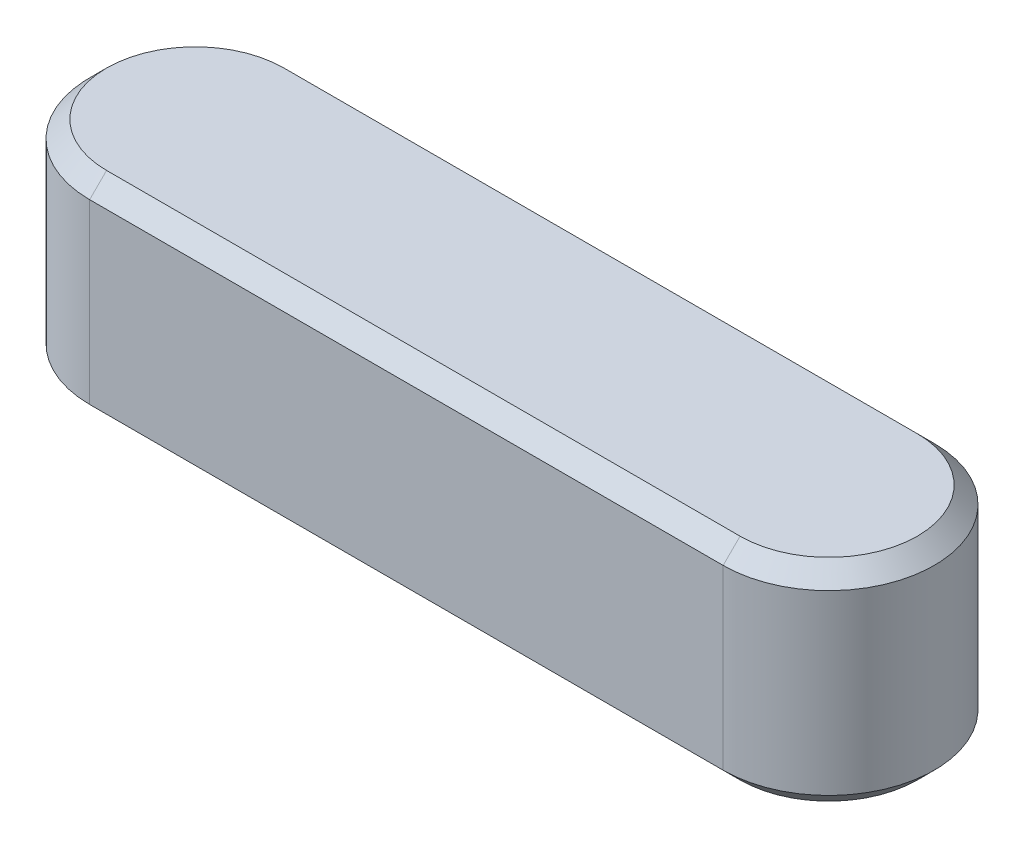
ISO-10303-21;
HEADER;
FILE_DESCRIPTION(('STEP AP214'),'2;1');
FILE_NAME('part.step','',(''),(''),'','','');
FILE_SCHEMA(('AUTOMOTIVE_DESIGN { 1 0 10303 214 1 1 1 1 }'));
ENDSEC;
DATA;
#1=APPLICATION_CONTEXT('core data for automotive mechanical design processes');
#2=APPLICATION_PROTOCOL_DEFINITION('international standard','automotive_design',2000,#1);
#3=PRODUCT_CONTEXT('',#1,'mechanical');
#4=PRODUCT('Part','Part','',(#3));
#5=PRODUCT_RELATED_PRODUCT_CATEGORY('part','',(#4));
#6=PRODUCT_DEFINITION_FORMATION('','',#4);
#7=PRODUCT_DEFINITION_CONTEXT('part definition',#1,'design');
#8=PRODUCT_DEFINITION('design','',#6,#7);
#9=PRODUCT_DEFINITION_SHAPE('','',#8);
#10=(LENGTH_UNIT() NAMED_UNIT(*) SI_UNIT(.MILLI.,.METRE.));
#11=(NAMED_UNIT(*) PLANE_ANGLE_UNIT() SI_UNIT($,.RADIAN.));
#12=(NAMED_UNIT(*) SI_UNIT($,.STERADIAN.) SOLID_ANGLE_UNIT());
#13=UNCERTAINTY_MEASURE_WITH_UNIT(LENGTH_MEASURE(1.E-05),#10,'distance_accuracy_value','');
#14=(GEOMETRIC_REPRESENTATION_CONTEXT(3) GLOBAL_UNCERTAINTY_ASSIGNED_CONTEXT((#13)) GLOBAL_UNIT_ASSIGNED_CONTEXT((#10,
#11,#12)) REPRESENTATION_CONTEXT('',''));
#15=CARTESIAN_POINT('',(0.,0.,0.));
#16=DIRECTION('',(0.,0.,1.));
#17=DIRECTION('',(1.,0.,0.));
#18=AXIS2_PLACEMENT_3D('',#15,#16,#17);
#19=CARTESIAN_POINT('',(7.,0.,0.));
#20=DIRECTION('',(0.,-1.,0.));
#21=DIRECTION('',(0.,0.,-1.));
#22=AXIS2_PLACEMENT_3D('',#19,#20,#21);
#23=CYLINDRICAL_SURFACE('',#22,1.);
#24=DIRECTION('',(0.,-1.,0.));
#25=VECTOR('',#24,1.);
#26=CARTESIAN_POINT('',(7.,2.,1.));
#27=LINE('',#26,#25);
#28=CARTESIAN_POINT('',(7.,0.16,1.));
#29=VERTEX_POINT('',#28);
#30=CARTESIAN_POINT('',(7.,1.84,1.));
#31=VERTEX_POINT('',#30);
#32=EDGE_CURVE('E122',#29,#31,#27,.F.);
#33=ORIENTED_EDGE('',*,*,#32,.F.);
#34=CARTESIAN_POINT('',(7.,0.16,0.));
#35=DIRECTION('',(0.,-1.,0.));
#36=DIRECTION('',(0.,0.,-1.));
#37=AXIS2_PLACEMENT_3D('',#34,#35,#36);
#38=CIRCLE('',#37,1.);
#39=CARTESIAN_POINT('',(7.,0.16,-1.));
#40=VERTEX_POINT('',#39);
#41=EDGE_CURVE('E121',#29,#40,#38,.F.);
#42=ORIENTED_EDGE('',*,*,#41,.T.);
#43=DIRECTION('',(0.,-1.,0.));
#44=VECTOR('',#43,1.);
#45=CARTESIAN_POINT('',(7.,2.,-1.));
#46=LINE('',#45,#44);
#47=CARTESIAN_POINT('',(7.,1.84,-1.));
#48=VERTEX_POINT('',#47);
#49=EDGE_CURVE('E105',#48,#40,#46,.T.);
#50=ORIENTED_EDGE('',*,*,#49,.F.);
#51=CARTESIAN_POINT('',(7.,1.84,0.));
#52=DIRECTION('',(0.,-1.,0.));
#53=DIRECTION('',(0.,0.,-1.));
#54=AXIS2_PLACEMENT_3D('',#51,#52,#53);
#55=CIRCLE('',#54,1.);
#56=EDGE_CURVE('E118',#48,#31,#55,.T.);
#57=ORIENTED_EDGE('',*,*,#56,.T.);
#58=EDGE_LOOP('',(#33,#42,#50,#57));
#59=FACE_BOUND('',#58,.T.);
#60=ADVANCED_FACE('F33',(#59),#23,.T.);
#61=CARTESIAN_POINT('',(1.,2.,0.));
#62=DIRECTION('',(0.,-1.,0.));
#63=DIRECTION('',(0.,0.,-1.));
#64=AXIS2_PLACEMENT_3D('',#61,#62,#63);
#65=CYLINDRICAL_SURFACE('',#64,1.);
#66=DIRECTION('',(0.,-1.,0.));
#67=VECTOR('',#66,1.);
#68=CARTESIAN_POINT('',(1.,2.,-1.));
#69=LINE('',#68,#67);
#70=CARTESIAN_POINT('',(1.,0.16,-1.));
#71=VERTEX_POINT('',#70);
#72=CARTESIAN_POINT('',(1.,1.84,-1.));
#73=VERTEX_POINT('',#72);
#74=EDGE_CURVE('E108',#71,#73,#69,.F.);
#75=ORIENTED_EDGE('',*,*,#74,.F.);
#76=CARTESIAN_POINT('',(1.,0.16,0.));
#77=DIRECTION('',(0.,-1.,0.));
#78=DIRECTION('',(0.,0.,-1.));
#79=AXIS2_PLACEMENT_3D('',#76,#77,#78);
#80=CIRCLE('',#79,1.);
#81=CARTESIAN_POINT('',(1.,0.16,1.));
#82=VERTEX_POINT('',#81);
#83=EDGE_CURVE('E159',#71,#82,#80,.F.);
#84=ORIENTED_EDGE('',*,*,#83,.T.);
#85=DIRECTION('',(0.,-1.,0.));
#86=VECTOR('',#85,1.);
#87=CARTESIAN_POINT('',(1.,2.,1.));
#88=LINE('',#87,#86);
#89=CARTESIAN_POINT('',(1.,1.84,1.));
#90=VERTEX_POINT('',#89);
#91=EDGE_CURVE('E146',#90,#82,#88,.T.);
#92=ORIENTED_EDGE('',*,*,#91,.F.);
#93=CARTESIAN_POINT('',(1.,1.84,0.));
#94=DIRECTION('',(0.,-1.,0.));
#95=DIRECTION('',(0.,0.,-1.));
#96=AXIS2_PLACEMENT_3D('',#93,#94,#95);
#97=CIRCLE('',#96,1.);
#98=EDGE_CURVE('E161',#90,#73,#97,.T.);
#99=ORIENTED_EDGE('',*,*,#98,.T.);
#100=EDGE_LOOP('',(#75,#84,#92,#99));
#101=FACE_BOUND('',#100,.T.);
#102=ADVANCED_FACE('F209',(#101),#65,.T.);
#103=CARTESIAN_POINT('',(0.,2.,-1.));
#104=DIRECTION('',(0.,0.,1.));
#105=DIRECTION('',(1.,0.,0.));
#106=AXIS2_PLACEMENT_3D('',#103,#104,#105);
#107=PLANE('',#106);
#108=ORIENTED_EDGE('',*,*,#49,.T.);
#109=DIRECTION('',(-1.,0.,0.));
#110=VECTOR('',#109,1.);
#111=CARTESIAN_POINT('',(1.,0.16,-1.));
#112=LINE('',#111,#110);
#113=EDGE_CURVE('E113',#40,#71,#112,.T.);
#114=ORIENTED_EDGE('',*,*,#113,.T.);
#115=ORIENTED_EDGE('',*,*,#74,.T.);
#116=DIRECTION('',(1.,0.,0.));
#117=VECTOR('',#116,1.);
#118=CARTESIAN_POINT('',(0.,1.84,-1.));
#119=LINE('',#118,#117);
#120=EDGE_CURVE('E101',#73,#48,#119,.T.);
#121=ORIENTED_EDGE('',*,*,#120,.T.);
#122=EDGE_LOOP('',(#108,#114,#115,#121));
#123=FACE_BOUND('',#122,.T.);
#124=ADVANCED_FACE('F103',(#123),#107,.F.);
#125=CARTESIAN_POINT('',(8.,2.,1.));
#126=DIRECTION('',(0.,0.,-1.));
#127=DIRECTION('',(-1.,0.,0.));
#128=AXIS2_PLACEMENT_3D('',#125,#126,#127);
#129=PLANE('',#128);
#130=ORIENTED_EDGE('',*,*,#91,.T.);
#131=DIRECTION('',(1.,0.,0.));
#132=VECTOR('',#131,1.);
#133=CARTESIAN_POINT('',(7.,0.16,1.));
#134=LINE('',#133,#132);
#135=EDGE_CURVE('E155',#82,#29,#134,.T.);
#136=ORIENTED_EDGE('',*,*,#135,.T.);
#137=ORIENTED_EDGE('',*,*,#32,.T.);
#138=DIRECTION('',(-1.,0.,0.));
#139=VECTOR('',#138,1.);
#140=CARTESIAN_POINT('',(8.,1.84,1.));
#141=LINE('',#140,#139);
#142=EDGE_CURVE('E157',#31,#90,#141,.T.);
#143=ORIENTED_EDGE('',*,*,#142,.T.);
#144=EDGE_LOOP('',(#130,#136,#137,#143));
#145=FACE_BOUND('',#144,.T.);
#146=ADVANCED_FACE('F179',(#145),#129,.F.);
#147=CARTESIAN_POINT('',(8.,2.,-1.));
#148=DIRECTION('',(0.,-1.,0.));
#149=DIRECTION('',(0.,0.,-1.));
#150=AXIS2_PLACEMENT_3D('',#147,#148,#149);
#151=PLANE('',#150);
#152=DIRECTION('',(-1.,0.,0.));
#153=VECTOR('',#152,1.);
#154=CARTESIAN_POINT('',(8.,2.,-0.840000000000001));
#155=LINE('',#154,#153);
#156=CARTESIAN_POINT('',(7.,2.,-0.840000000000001));
#157=VERTEX_POINT('',#156);
#158=CARTESIAN_POINT('',(1.,2.,-0.840000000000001));
#159=VERTEX_POINT('',#158);
#160=EDGE_CURVE('E134',#157,#159,#155,.T.);
#161=ORIENTED_EDGE('',*,*,#160,.T.);
#162=CARTESIAN_POINT('',(1.,2.,0.));
#163=DIRECTION('',(0.,-1.,0.));
#164=DIRECTION('',(0.,0.,-1.));
#165=AXIS2_PLACEMENT_3D('',#162,#163,#164);
#166=CIRCLE('',#165,0.840000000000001);
#167=CARTESIAN_POINT('',(1.,2.,0.840000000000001));
#168=VERTEX_POINT('',#167);
#169=EDGE_CURVE('E11',#159,#168,#166,.F.);
#170=ORIENTED_EDGE('',*,*,#169,.T.);
#171=DIRECTION('',(1.,0.,0.));
#172=VECTOR('',#171,1.);
#173=CARTESIAN_POINT('',(8.,2.,0.840000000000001));
#174=LINE('',#173,#172);
#175=CARTESIAN_POINT('',(7.,2.,0.840000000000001));
#176=VERTEX_POINT('',#175);
#177=EDGE_CURVE('E42',#168,#176,#174,.T.);
#178=ORIENTED_EDGE('',*,*,#177,.T.);
#179=CARTESIAN_POINT('',(7.,2.,0.));
#180=DIRECTION('',(0.,-1.,0.));
#181=DIRECTION('',(0.,0.,-1.));
#182=AXIS2_PLACEMENT_3D('',#179,#180,#181);
#183=CIRCLE('',#182,0.840000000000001);
#184=EDGE_CURVE('E152',#176,#157,#183,.F.);
#185=ORIENTED_EDGE('',*,*,#184,.T.);
#186=EDGE_LOOP('',(#161,#170,#178,#185));
#187=FACE_BOUND('',#186,.T.);
#188=ADVANCED_FACE('F234',(#187),#151,.F.);
#189=CARTESIAN_POINT('',(8.,0.,-1.));
#190=DIRECTION('',(0.,-1.,0.));
#191=DIRECTION('',(0.,0.,-1.));
#192=AXIS2_PLACEMENT_3D('',#189,#190,#191);
#193=PLANE('',#192);
#194=CARTESIAN_POINT('',(1.,0.,0.));
#195=DIRECTION('',(0.,-1.,0.));
#196=DIRECTION('',(0.,0.,-1.));
#197=AXIS2_PLACEMENT_3D('',#194,#195,#196);
#198=CIRCLE('',#197,0.839999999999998);
#199=CARTESIAN_POINT('',(1.,0.,0.839999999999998));
#200=VERTEX_POINT('',#199);
#201=CARTESIAN_POINT('',(1.,0.,-0.839999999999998));
#202=VERTEX_POINT('',#201);
#203=EDGE_CURVE('E168',#200,#202,#198,.T.);
#204=ORIENTED_EDGE('',*,*,#203,.T.);
#205=DIRECTION('',(1.,0.,0.));
#206=VECTOR('',#205,1.);
#207=CARTESIAN_POINT('',(7.,0.,-0.839999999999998));
#208=LINE('',#207,#206);
#209=CARTESIAN_POINT('',(7.,0.,-0.839999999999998));
#210=VERTEX_POINT('',#209);
#211=EDGE_CURVE('E131',#202,#210,#208,.T.);
#212=ORIENTED_EDGE('',*,*,#211,.T.);
#213=CARTESIAN_POINT('',(7.,0.,0.));
#214=DIRECTION('',(0.,-1.,0.));
#215=DIRECTION('',(0.,0.,-1.));
#216=AXIS2_PLACEMENT_3D('',#213,#214,#215);
#217=CIRCLE('',#216,0.839999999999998);
#218=CARTESIAN_POINT('',(7.,0.,0.839999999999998));
#219=VERTEX_POINT('',#218);
#220=EDGE_CURVE('E166',#210,#219,#217,.T.);
#221=ORIENTED_EDGE('',*,*,#220,.T.);
#222=DIRECTION('',(-1.,0.,0.));
#223=VECTOR('',#222,1.);
#224=CARTESIAN_POINT('',(1.,0.,0.839999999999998));
#225=LINE('',#224,#223);
#226=EDGE_CURVE('E170',#219,#200,#225,.T.);
#227=ORIENTED_EDGE('',*,*,#226,.T.);
#228=EDGE_LOOP('',(#204,#212,#221,#227));
#229=FACE_BOUND('',#228,.T.);
#230=ADVANCED_FACE('F193',(#229),#193,.T.);
#231=CARTESIAN_POINT('',(8.,0.16,1.));
#232=DIRECTION('',(0.,-0.707106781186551,0.707106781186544));
#233=DIRECTION('',(0.,-0.707106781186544,-0.707106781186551));
#234=AXIS2_PLACEMENT_3D('',#231,#232,#233);
#235=PLANE('',#234);
#236=DIRECTION('',(0.,0.707106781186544,0.707106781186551));
#237=VECTOR('',#236,1.);
#238=CARTESIAN_POINT('',(1.,0.,0.839999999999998));
#239=LINE('',#238,#237);
#240=EDGE_CURVE('E147',#200,#82,#239,.T.);
#241=ORIENTED_EDGE('',*,*,#240,.F.);
#242=ORIENTED_EDGE('',*,*,#226,.F.);
#243=DIRECTION('',(0.,-0.707106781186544,-0.707106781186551));
#244=VECTOR('',#243,1.);
#245=CARTESIAN_POINT('',(7.,0.16,1.));
#246=LINE('',#245,#244);
#247=EDGE_CURVE('E143',#29,#219,#246,.T.);
#248=ORIENTED_EDGE('',*,*,#247,.F.);
#249=ORIENTED_EDGE('',*,*,#135,.F.);
#250=EDGE_LOOP('',(#241,#242,#248,#249));
#251=FACE_BOUND('',#250,.T.);
#252=ADVANCED_FACE('F184',(#251),#235,.T.);
#253=CARTESIAN_POINT('',(7.,0.,0.));
#254=DIRECTION('',(0.,1.,0.));
#255=DIRECTION('',(0.,0.,1.));
#256=AXIS2_PLACEMENT_3D('',#253,#254,#255);
#257=CONICAL_SURFACE('',#256,0.839999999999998,0.785398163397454);
#258=ORIENTED_EDGE('',*,*,#247,.T.);
#259=ORIENTED_EDGE('',*,*,#220,.F.);
#260=DIRECTION('',(0.,-0.707106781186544,0.707106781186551));
#261=VECTOR('',#260,1.);
#262=CARTESIAN_POINT('',(7.,0.16,-1.));
#263=LINE('',#262,#261);
#264=EDGE_CURVE('E136',#40,#210,#263,.T.);
#265=ORIENTED_EDGE('',*,*,#264,.F.);
#266=ORIENTED_EDGE('',*,*,#41,.F.);
#267=EDGE_LOOP('',(#258,#259,#265,#266));
#268=FACE_BOUND('',#267,.T.);
#269=ADVANCED_FACE('F199',(#268),#257,.T.);
#270=CARTESIAN_POINT('',(1.,0.,0.));
#271=DIRECTION('',(0.,1.,0.));
#272=DIRECTION('',(0.,0.,1.));
#273=AXIS2_PLACEMENT_3D('',#270,#271,#272);
#274=CONICAL_SURFACE('',#273,0.839999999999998,0.785398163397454);
#275=ORIENTED_EDGE('',*,*,#240,.T.);
#276=ORIENTED_EDGE('',*,*,#83,.F.);
#277=DIRECTION('',(0.,0.707106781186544,-0.707106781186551));
#278=VECTOR('',#277,1.);
#279=CARTESIAN_POINT('',(1.,0.,-0.839999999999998));
#280=LINE('',#279,#278);
#281=EDGE_CURVE('E135',#202,#71,#280,.T.);
#282=ORIENTED_EDGE('',*,*,#281,.F.);
#283=ORIENTED_EDGE('',*,*,#203,.F.);
#284=EDGE_LOOP('',(#275,#276,#282,#283));
#285=FACE_BOUND('',#284,.T.);
#286=ADVANCED_FACE('F189',(#285),#274,.T.);
#287=CARTESIAN_POINT('',(0.,0.16,-1.));
#288=DIRECTION('',(0.,-0.707106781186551,-0.707106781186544));
#289=DIRECTION('',(0.,0.707106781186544,-0.707106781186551));
#290=AXIS2_PLACEMENT_3D('',#287,#288,#289);
#291=PLANE('',#290);
#292=ORIENTED_EDGE('',*,*,#264,.T.);
#293=ORIENTED_EDGE('',*,*,#211,.F.);
#294=ORIENTED_EDGE('',*,*,#281,.T.);
#295=ORIENTED_EDGE('',*,*,#113,.F.);
#296=EDGE_LOOP('',(#292,#293,#294,#295));
#297=FACE_BOUND('',#296,.T.);
#298=ADVANCED_FACE('F195',(#297),#291,.T.);
#299=CARTESIAN_POINT('',(7.,2.,0.));
#300=DIRECTION('',(0.,-1.,0.));
#301=DIRECTION('',(0.,0.,-1.));
#302=AXIS2_PLACEMENT_3D('',#299,#300,#301);
#303=CONICAL_SURFACE('',#302,0.840000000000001,0.785398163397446);
#304=DIRECTION('',(0.,0.707106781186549,-0.707106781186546));
#305=VECTOR('',#304,1.);
#306=CARTESIAN_POINT('',(7.,1.84,1.));
#307=LINE('',#306,#305);
#308=EDGE_CURVE('E129',#31,#176,#307,.T.);
#309=ORIENTED_EDGE('',*,*,#308,.F.);
#310=ORIENTED_EDGE('',*,*,#56,.F.);
#311=DIRECTION('',(0.,-0.707106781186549,-0.707106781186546));
#312=VECTOR('',#311,1.);
#313=CARTESIAN_POINT('',(7.,2.,-0.840000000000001));
#314=LINE('',#313,#312);
#315=EDGE_CURVE('E37',#157,#48,#314,.T.);
#316=ORIENTED_EDGE('',*,*,#315,.F.);
#317=ORIENTED_EDGE('',*,*,#184,.F.);
#318=EDGE_LOOP('',(#309,#310,#316,#317));
#319=FACE_BOUND('',#318,.T.);
#320=ADVANCED_FACE('F35',(#319),#303,.T.);
#321=CARTESIAN_POINT('',(8.,2.,-0.840000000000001));
#322=DIRECTION('',(0.,-0.707106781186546,0.707106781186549));
#323=DIRECTION('',(0.,-0.707106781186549,-0.707106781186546));
#324=AXIS2_PLACEMENT_3D('',#321,#322,#323);
#325=PLANE('',#324);
#326=ORIENTED_EDGE('',*,*,#315,.T.);
#327=ORIENTED_EDGE('',*,*,#120,.F.);
#328=DIRECTION('',(0.,-0.707106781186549,-0.707106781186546));
#329=VECTOR('',#328,1.);
#330=CARTESIAN_POINT('',(1.,2.,-0.840000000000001));
#331=LINE('',#330,#329);
#332=EDGE_CURVE('E138',#159,#73,#331,.T.);
#333=ORIENTED_EDGE('',*,*,#332,.F.);
#334=ORIENTED_EDGE('',*,*,#160,.F.);
#335=EDGE_LOOP('',(#326,#327,#333,#334));
#336=FACE_BOUND('',#335,.T.);
#337=ADVANCED_FACE('F133',(#336),#325,.F.);
#338=CARTESIAN_POINT('',(8.,2.,0.840000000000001));
#339=DIRECTION('',(0.,-0.707106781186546,-0.707106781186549));
#340=DIRECTION('',(0.,0.707106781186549,-0.707106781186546));
#341=AXIS2_PLACEMENT_3D('',#338,#339,#340);
#342=PLANE('',#341);
#343=ORIENTED_EDGE('',*,*,#308,.T.);
#344=ORIENTED_EDGE('',*,*,#177,.F.);
#345=DIRECTION('',(0.,0.707106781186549,-0.707106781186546));
#346=VECTOR('',#345,1.);
#347=CARTESIAN_POINT('',(1.,1.84,1.));
#348=LINE('',#347,#346);
#349=EDGE_CURVE('E50',#90,#168,#348,.T.);
#350=ORIENTED_EDGE('',*,*,#349,.F.);
#351=ORIENTED_EDGE('',*,*,#142,.F.);
#352=EDGE_LOOP('',(#343,#344,#350,#351));
#353=FACE_BOUND('',#352,.T.);
#354=ADVANCED_FACE('F224',(#353),#342,.F.);
#355=CARTESIAN_POINT('',(1.,2.,0.));
#356=DIRECTION('',(0.,-1.,0.));
#357=DIRECTION('',(0.,0.,-1.));
#358=AXIS2_PLACEMENT_3D('',#355,#356,#357);
#359=CONICAL_SURFACE('',#358,0.840000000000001,0.785398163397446);
#360=ORIENTED_EDGE('',*,*,#332,.T.);
#361=ORIENTED_EDGE('',*,*,#98,.F.);
#362=ORIENTED_EDGE('',*,*,#349,.T.);
#363=ORIENTED_EDGE('',*,*,#169,.F.);
#364=EDGE_LOOP('',(#360,#361,#362,#363));
#365=FACE_BOUND('',#364,.T.);
#366=ADVANCED_FACE('F228',(#365),#359,.T.);
#367=CLOSED_SHELL('',(#60,#102,#124,#146,#188,#230,#252,#269,#286,#298,#320,#337,#354,#366));
#368=MANIFOLD_SOLID_BREP('B2',#367);
#369=ADVANCED_BREP_SHAPE_REPRESENTATION('',(#18,#368),#14);
#370=SHAPE_DEFINITION_REPRESENTATION(#9,#369);
ENDSEC;
END-ISO-10303-21;
